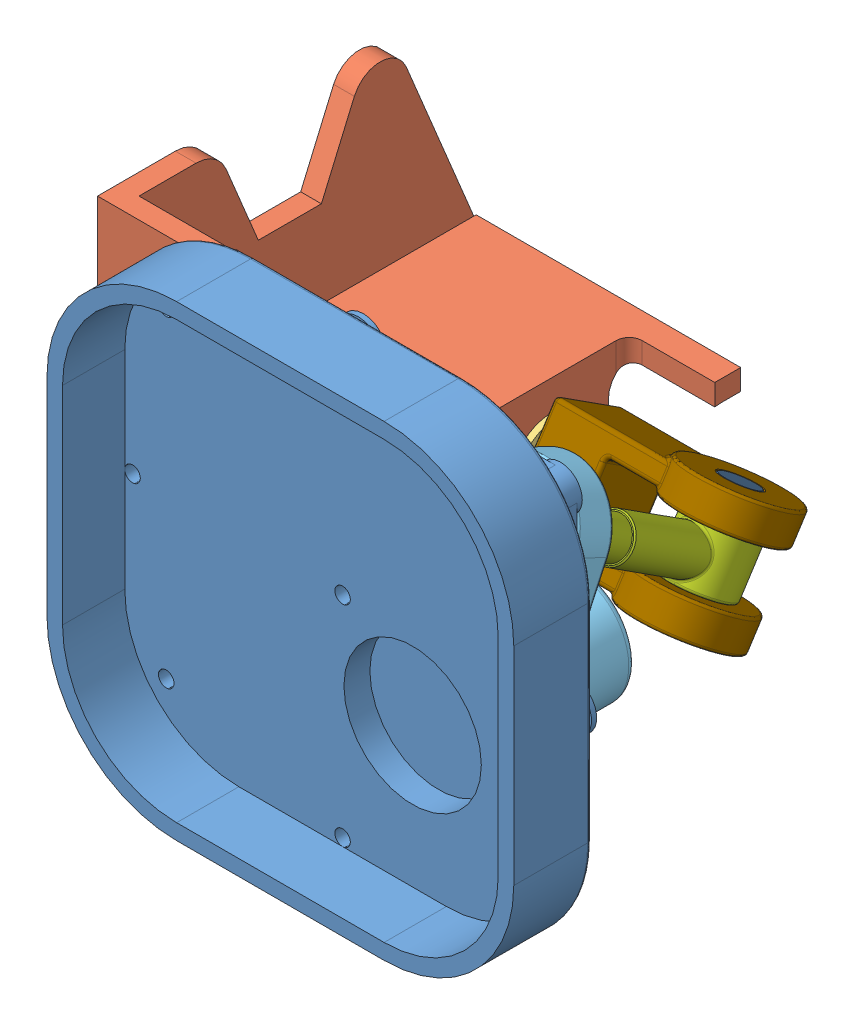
SolidWorks assembly PORTEPEAGE-SolidWorks 2018.SLDASM, configuration Défaut (file format 11000). Lengths in mm.
Overall size (506 525.27 473.59).
18 component instances, 12 part files, 8 mates.
Components (placement in the parent):
- Bati-1: Bati.SLDASM [Défaut] at (34.0419 25.9639 91) size (406 360 356)
  - reducteur-1: reducteur.SLDPRT [Défaut] at (-252.4721 -127.2379 27) size (360 360 174)
  - Bati-1: Bati.SLDPRT [Défaut] at (-293.4721 42.2621 7) x (0 -1 0) z (1 0 0) size (301 276 243)
  - Bague-1: Bague.SLDPRT [Défaut] at (-134.4721 -7.2379 -190) x (-1 0 0) z (0 0.924225 -0.381849) size (50 68.6 68.6)
  - Bague-2: Bague.SLDPRT [Défaut] at (-298.4721 -7.2379 -190) x (1 0 0) z (0 0.094472 0.995528) size (50 68.6 68.6)
  - Vis-1: Vis.SLDPRT [M8-1.25] at (-208.4721 -71.2379 -9) x (0.133526 0.991045 0) z (0 0 -1) size (27 27 38)
  - Vis-2: Vis.SLDPRT [M8-1.25] at (-72.4721 52.7621 -9) x (0.375037 -0.92701 0) z (0 0 -1) size (27 27 38)
  - Vis-3: Vis.SLDPRT [M8-1.25] at (-208.4721 176.7621 -9) x (0.607105 -0.794622 0) z (0 0 -1) size (27 27 38)
- Plateau-1: Plateau.SLDASM [Défaut] at (16.4935 140.2032 101.5403) x (0 1 0) z (-1 0 0) size (174.55 96 88.14)
  - plateau-1: plateau.SLDPRT [Défaut] at (-121.4772 3.5403 0.9236) size (174.55 96 88.14)
  - Loctite-1: Loctite.SLDPRT [Défaut] at (-36.6458 68.708 0.9236) x (-0.167203 -0.077968 -0.982835) z (0.890751 0.415364 -0.184488) size (59.2 20 59.2)
- Croisillon-1: Croisillon.SLDPRT [Défaut] at (15.5699 67.698 -22.8949) x (1 0 0) z (0 0.541128 0.84094) size (50 40 175.5)
- Rotule-1: Rotule.SLDPRT [Défaut] at (15.5699 103.5574 32.8323) x (-0.210373 0.822121 -0.529018) z (0.977621 0.176911 -0.113839) size (49 28 49)
- Porte-1: Porte.SLDASM [Défaut] at (-193.5468 -0.1439 -86.8576) x (-1 0 0) z (0 -0.541128 -0.84094) size (420 268.69 253.92)
  - ArbreFourche-1: ArbreFourche.SLDPRT [Défaut] at (-93.1167 22.439 0) size (420 88 80)
  - Goupille-1: Goupille.SLDPRT [Défaut] at (-209.1167 66.439 0) x (-0.047297 0 -0.998881) z (0 -1 0) size (30 30 88)
  - Barre-1: Barre.SLDPRT [Défaut] at (97.8833 22.439 0) x (0 0.741413 -0.671049) z (-1 0 0) size (290 80 50)
  - Ecrou-1: Ecrou.SLDPRT [M8-1.25] at (122.8833 22.439 0) x (0 -0.171163 -0.985243) z (1 0 0) size (80 80 28)
Mates (geometry in assembly coordinates):
- Coïncidente1: coincident: plane of Bati-1/reducteur-1 through (15.5699 18.726 98) normal (0 0 -1); plane of Plateau-1/plateau-1 through (15.5699 -14.974 98) normal (0 0 1)
- Concentrique1: concentric: cylinder of Bati-1/reducteur-1 through (15.5699 18.726 4) axis (0 0 1) radius 18.5; cylinder of Plateau-1/plateau-1 through (15.5699 18.726 -3.2789) axis (0 0 -1) radius 18.5
- Coïncidente2: coincident: point of Plateau-1/Loctite-1; point of Rotule-1
- Concentrique2: concentric: cylinder of Croisillon-1 through (15.5699 100.1657 27.5615) axis (0 -0.541128 -0.84094) radius 14.6; cylinder of Rotule-1 through (15.5699 114.7597 50.2413) axis (0 0.541128 0.84094) radius 14.6
- Coïncidente3: coincident: plane of Bati-1/Bague-1 through (-100.4301 9.1797 -122.1056) normal (1 0 0); plane of Porte-1/ArbreFourche-1 through (-100.4301 -28.6227 -104.2065) normal (-1 0 0)
- Concentrique5: concentric: cylinder of Croisillon-1 through (15.5699 1.9072 -88.1774) axis (0 0.84094 -0.541128) radius 15; cylinder of Porte-1/Goupille-1 through (15.5699 -18.2754 -75.1904) axis (0 0.84094 -0.541128) radius 15
- Concentrique6: concentric: cylinder of Bati-1/Bague-1 through (-100.4301 18.726 -99) axis (1 0 0) radius 25; cylinder of Porte-1/ArbreFourche-1 through (-266.4301 18.726 -99) axis (1 0 0) radius 25
- A distance1: distance: plane of Croisillon-1 through (15.5699 35.5448 -109.8226) normal (0 0.84094 -0.541128); plane of Porte-1/ArbreFourche-1 through (65.884 59.3544 -72.8212) normal (0 -0.84094 0.541128)
